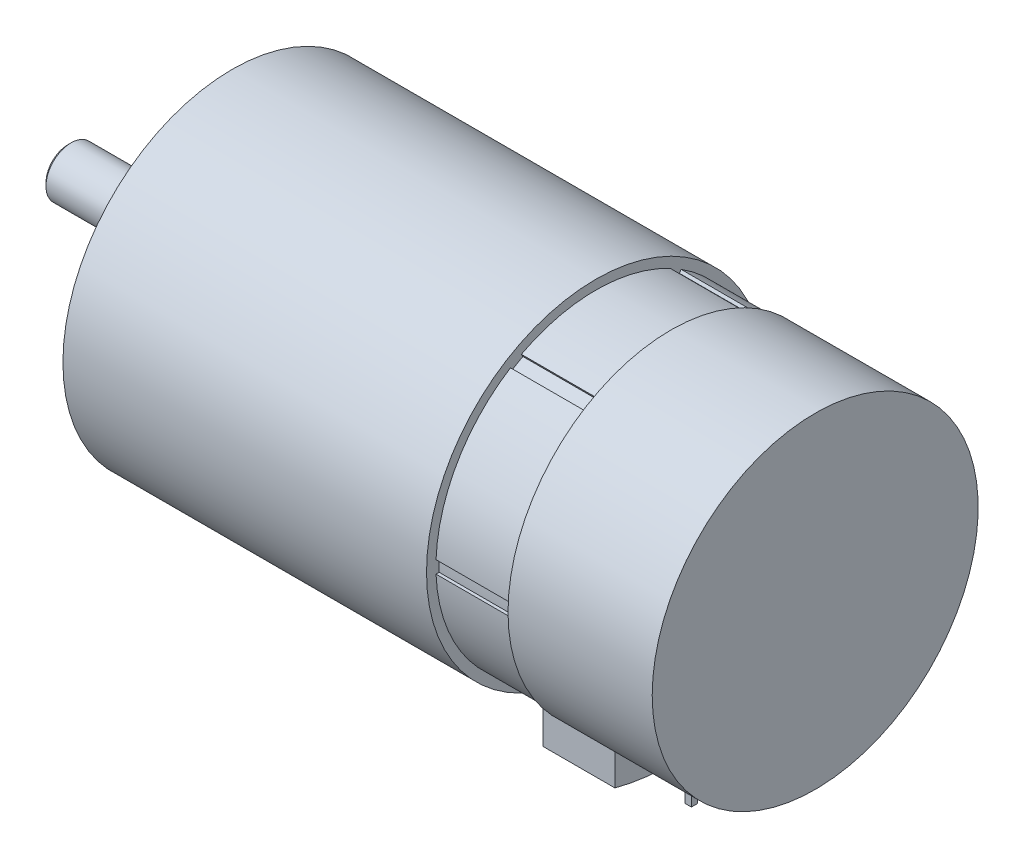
from build123d import *
from build123d.topology import SkipClean

# Parameters (mm, degrees)
SKETCH2_R                           = 2
CUT_EXTRUDE1_DEPTH                  = 6
BOSS_EXTRUDE1_START                 = 96.2
BOSS_EXTRUDE1_DEPTH                 = 11.5
CUT_EXTRUDE4_START                  = -23
CUT_EXTRUDE4_DEPTH                  = 12
BOSS_EXTRUDE2_START                 = -12.2
BOSS_EXTRUDE2_DEPTH                 = 5.8
CUT_EXTRUDE5_REACH                  = 136.563
CUT_EXTRUDE5_END_RADIUS             = 25.5
SKETCH8_W                           = 8.5
SKETCH8_H                           = 14.9
SKETCH8_W_2                         = 3.8
SKETCH8_H_2                         = 10
CUT_EXTRUDE5_DIRECTION_2_REACH      = 136.563
CUT_EXTRUDE5_DIRECTION_2_END_RADIUS = 34
CUT_EXTRUDE6_START                  = -10
CUT_EXTRUDE6_DEPTH                  = 10
CUT_EXTRUDE7_REACH                  = 136.563
CUT_EXTRUDE7_END_RADIUS             = 25.5
SKETCH10_W                          = 10.5
SKETCH10_H                          = 16.9
CUT_EXTRUDE7_DIRECTION_2_REACH      = 136.563
CUT_EXTRUDE7_DIRECTION_2_END_RADIUS = 33.5
CUT_EXTRUDE9_REACH                  = 137.063
CUT_EXTRUDE9_END_RADIUS             = 25.5
CUT_EXTRUDE9_START                  = -0.5
SKETCH12_W                          = 4.8
SKETCH12_H                          = 11
BOSS_EXTRUDE3_REACH                 = 136.563
BOSS_EXTRUDE3_END_RADIUS            = 25.5
SKETCH13_W                          = 2
SKETCH13_H                          = 2
SKETCH13_W_2                        = 1
SKETCH13_H_2                        = 1
BOSS_EXTRUDE3_DIRECTION_2_DEPTH     = 6
SKETCH14_OUTSIDE_W                  = 151.196
SKETCH14_OUTSIDE_H                  = 85.996
SKETCH14_OUTSIDE_W_2                = 1
SKETCH14_OUTSIDE_H_2                = 1
CUT_EXTRUDE11_DEPTH                 = 1.25
CUT_EXTRUDE11_TAPER                 = 22


with BuildPart() as part:
    # Sketch1 → Revolve1 (revolve)
    with BuildSketch(Plane(origin=(0, 0, 0), x_dir=(1, 0, 0), z_dir=(0, 1, 0)), mode=Mode.PRIVATE) as revolve1_sk:
        Polygon((0, 0), (0, 3.5), (0.5, 4), (22.2, 4), (22.2, 10), (23.2, 11), (26.2, 11), (26.2, 27), (84.2, 27), (84.2, 25.5), (96.2, 25.5), (96.2, 26), (119.2, 26), (119.2, 0), align=None)
    revolve(revolve1_sk.sketch.rotate(Axis((0, 0, 0), (1, 0, 0)), 180), axis=Axis((0, 0, 0), (1, 0, 0)))

    # Sketch2 → Cut-Extrude1 (cut)
    with BuildSketch(Plane.ZY.offset(-26.2)):
        with Locations((14.849242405, 14.849242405)):
            Circle(SKETCH2_R)
        with Locations((14.849242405, -14.849242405)):
            Circle(SKETCH2_R)
        with Locations((-14.849242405, -14.849242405)):
            Circle(SKETCH2_R)
        with Locations((-14.849242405, 14.849242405)):
            Circle(SKETCH2_R)
    extrude(amount=-CUT_EXTRUDE1_DEPTH, mode=Mode.SUBTRACT)

    # Sketch3 → Boss-Extrude1 (add)
    with BuildSketch(Plane(origin=(0, 0, 0), x_dir=(0, 0, -1), z_dir=(1, 0, 0)).offset(BOSS_EXTRUDE1_START)):
        with BuildLine():
            Line((-8.95, -32.800876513), (-8.95, -23.87776162))
            ThreePointArc((-8.95, -23.87776162), (0, -25.5), (8.95, -23.87776162))
            Line((8.95, -23.87776162), (8.95, -32.800876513))
            ThreePointArc((8.95, -32.800876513), (0, -34), (-8.95, -32.800876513))
        make_face()
    extrude(amount=-BOSS_EXTRUDE1_DEPTH)

    # Sketch5 → Cut-Extrude4 (cut)
    with BuildSketch(Plane(origin=(119.2, 0, 0), x_dir=(0, 0, -1), z_dir=(1, 0, 0)).offset(CUT_EXTRUDE4_START)):
        with BuildLine():
            Line((24.979991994, 1), (25.480384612, 1))
            ThreePointArc((25.480384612, 1), (25.5, 0), (25.480384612, -1))
            Line((25.480384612, -1), (24.979991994, -1))
            ThreePointArc((24.979991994, -1), (25, 0), (24.979991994, 1))
        make_face()
        with BuildLine():
            Line((13.356021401, -21.133307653), (13.60621771, -21.566660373))
            ThreePointArc((13.60621771, -21.566660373), (12.75, -22.083647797), (11.874166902, -22.566660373))
            Line((11.874166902, -22.566660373), (11.623970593, -22.133307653))
            ThreePointArc((11.623970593, -22.133307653), (12.5, -21.650635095), (13.356021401, -21.133307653))
        make_face()
        with BuildLine():
            Line((-11.623970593, -22.133307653), (-11.874166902, -22.566660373))
            ThreePointArc((-11.874166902, -22.566660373), (-12.75, -22.083647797), (-13.60621771, -21.566660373))
            Line((-13.60621771, -21.566660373), (-13.356021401, -21.133307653))
            ThreePointArc((-13.356021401, -21.133307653), (-12.5, -21.650635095), (-11.623970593, -22.133307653))
        make_face()
        with BuildLine():
            Line((-24.979991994, -1), (-25.480384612, -1))
            ThreePointArc((-25.480384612, -1), (-25.5, 0), (-25.480384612, 1))
            Line((-25.480384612, 1), (-24.979991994, 1))
            ThreePointArc((-24.979991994, 1), (-25, 0), (-24.979991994, -1))
        make_face()
        with BuildLine():
            Line((-13.356021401, 21.133307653), (-13.60621771, 21.566660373))
            ThreePointArc((-13.60621771, 21.566660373), (-12.75, 22.083647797), (-11.874166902, 22.566660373))
            Line((-11.874166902, 22.566660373), (-11.623970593, 22.133307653))
            ThreePointArc((-11.623970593, 22.133307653), (-12.5, 21.650635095), (-13.356021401, 21.133307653))
        make_face()
        with BuildLine():
            Line((11.623970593, 22.133307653), (11.874166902, 22.566660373))
            ThreePointArc((11.874166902, 22.566660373), (12.75, 22.083647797), (13.60621771, 21.566660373))
            Line((13.60621771, 21.566660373), (13.356021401, 21.133307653))
            ThreePointArc((13.356021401, 21.133307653), (12.5, 21.650635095), (11.623970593, 22.133307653))
        make_face()
    extrude(amount=-CUT_EXTRUDE4_DEPTH, mode=Mode.SUBTRACT)

    # Sketch6 → Boss-Extrude2 (add)
    with BuildSketch(Plane(origin=(119.2, 0, 0), x_dir=(0, 0, -1), z_dir=(1, 0, 0)).offset(BOSS_EXTRUDE2_START)):
        with BuildLine():
            Line((-6, -25.298221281), (-6, -29.298221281))
            Line((-6, -29.298221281), (6, -29.298221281))
            Line((6, -29.298221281), (6, -25.298221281))
            ThreePointArc((6, -25.298221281), (0, -26), (-6, -25.298221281))
        make_face()
    extrude(amount=-BOSS_EXTRUDE2_DEPTH)

    # Cut-Extrude5: up to this cylinder (the profile starts outside it)
    cut_extrude5_end = Plane(origin=(97.275, 0, 0), z_dir=(-1, 0, 0)) * Cylinder(CUT_EXTRUDE5_END_RADIUS, 338.776, mode=Mode.PRIVATE)
    # Sketch8 → Cut-Extrude5 (cut, up to the surface)
    with BuildSketch(Plane.XZ.offset(29.298221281), mode=Mode.PRIVATE) as cut_extrude5_sk1:
        with Locations((90.45, 0)):
            Rectangle(SKETCH8_W, SKETCH8_H)
    cut_extrude5_tool1 = extrude(cut_extrude5_sk1.sketch, amount=-CUT_EXTRUDE5_REACH, mode=Mode.PRIVATE) - cut_extrude5_end
    add(cut_extrude5_tool1.solids().sort_by_distance((90.45, -29.298221, 0))[0], mode=Mode.SUBTRACT)
    # Sketch8 → Cut-Extrude5 (cut, up to the surface)
    with BuildSketch(Plane.XZ.offset(29.298221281), mode=Mode.PRIVATE) as cut_extrude5_sk2:
        with Locations((104.1, 0)):
            Rectangle(SKETCH8_W_2, SKETCH8_H_2)
    cut_extrude5_tool2 = extrude(cut_extrude5_sk2.sketch, amount=-CUT_EXTRUDE5_REACH, mode=Mode.PRIVATE) - cut_extrude5_end
    add(cut_extrude5_tool2.solids().sort_by_distance((104.1, -29.298221, 0))[0], mode=Mode.SUBTRACT)

    # Cut-Extrude5 direction 2: up to this cylinder (the profile starts inside it)
    cut_extrude5_direction_2_end = Plane(origin=(97.275, 0, 0), z_dir=(-1, 0, 0)) * Cylinder(CUT_EXTRUDE5_DIRECTION_2_END_RADIUS, 355.776, mode=Mode.PRIVATE)
    # Sketch8 → Cut-Extrude5 direction 2 (cut, up to the surface)
    with BuildSketch(Plane.XZ.offset(29.298221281), mode=Mode.PRIVATE) as cut_extrude5_direction_2_sk1:
        with Locations((90.45, 0)):
            Rectangle(SKETCH8_W, SKETCH8_H)
    cut_extrude5_direction_2_tool1 = extrude(cut_extrude5_direction_2_sk1.sketch, amount=CUT_EXTRUDE5_DIRECTION_2_REACH, mode=Mode.PRIVATE) & cut_extrude5_direction_2_end
    add(cut_extrude5_direction_2_tool1.solids().sort_by_distance((90.45, -29.298221, 0))[0], mode=Mode.SUBTRACT)
    # Sketch8 → Cut-Extrude5 direction 2 (cut, up to the surface)
    with BuildSketch(Plane.XZ.offset(29.298221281), mode=Mode.PRIVATE) as cut_extrude5_direction_2_sk2:
        with Locations((104.1, 0)):
            Rectangle(SKETCH8_W_2, SKETCH8_H_2)
    cut_extrude5_direction_2_tool2 = extrude(cut_extrude5_direction_2_sk2.sketch, amount=CUT_EXTRUDE5_DIRECTION_2_REACH, mode=Mode.PRIVATE) & cut_extrude5_direction_2_end
    add(cut_extrude5_direction_2_tool2.solids().sort_by_distance((104.1, -29.298221, 0))[0], mode=Mode.SUBTRACT)

    # Sketch9 → Cut-Extrude6 (cut)
    with BuildSketch(Plane.ZY.offset(-84.7).offset(CUT_EXTRUDE6_START)):
        with BuildLine():
            Line((-7.45, -24.387445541), (-7.45, -33.17374715))
            ThreePointArc((-7.45, -33.17374715), (-6.701696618, -33.332975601), (-5.95, -33.475326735))
            Line((-5.95, -33.475326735), (-5.95, -24.796118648))
            ThreePointArc((-5.95, -24.796118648), (-6.703115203, -24.603216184), (-7.45, -24.387445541))
        make_face()
        with BuildLine():
            Line((7.45, -24.387445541), (7.45, -33.17374715))
            ThreePointArc((7.45, -33.17374715), (6.701696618, -33.332975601), (5.95, -33.475326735))
            Line((5.95, -33.475326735), (5.95, -24.796118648))
            ThreePointArc((5.95, -24.796118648), (6.703115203, -24.603216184), (7.45, -24.387445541))
        make_face()
    extrude(amount=CUT_EXTRUDE6_DEPTH, mode=Mode.SUBTRACT)

    # Cut-Extrude7: up to this cylinder (the profile starts outside it)
    with SkipClean():  # the faces are left unmerged after this step: merging them gives an invalid solid
        cut_extrude7_end = Plane(origin=(90.45, 0, 0), z_dir=(-1, 0, 0)) * Cylinder(CUT_EXTRUDE7_END_RADIUS, 325.126, mode=Mode.PRIVATE)
        # Sketch10 → Cut-Extrude7 (cut, up to the surface)
        with BuildSketch(Plane.XZ.offset(29.298221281), mode=Mode.PRIVATE) as cut_extrude7_sk1:
            with Locations((90.45, 0)):
                Rectangle(SKETCH10_W, SKETCH10_H)
        cut_extrude7_tool1 = extrude(cut_extrude7_sk1.sketch, amount=-CUT_EXTRUDE7_REACH, mode=Mode.PRIVATE) - cut_extrude7_end
        add(cut_extrude7_tool1.solids().sort_by_distance((90.45, -29.298221, 0))[0], mode=Mode.SUBTRACT)

    # Cut-Extrude7 direction 2: up to this cylinder (the profile starts inside it)
    with SkipClean():  # the faces are left unmerged after this step: merging them gives an invalid solid
        cut_extrude7_direction_2_end = Plane(origin=(90.45, 0, 0), z_dir=(-1, 0, 0)) * Cylinder(CUT_EXTRUDE7_DIRECTION_2_END_RADIUS, 341.126, mode=Mode.PRIVATE)
        # Sketch10 → Cut-Extrude7 direction 2 (cut, up to the surface)
        with BuildSketch(Plane.XZ.offset(29.298221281), mode=Mode.PRIVATE) as cut_extrude7_direction_2_sk1:
            with Locations((90.45, 0)):
                Rectangle(SKETCH10_W, SKETCH10_H)
        cut_extrude7_direction_2_tool1 = extrude(cut_extrude7_direction_2_sk1.sketch, amount=CUT_EXTRUDE7_DIRECTION_2_REACH, mode=Mode.PRIVATE) & cut_extrude7_direction_2_end
        add(cut_extrude7_direction_2_tool1.solids().sort_by_distance((90.45, -29.298221, 0))[0], mode=Mode.SUBTRACT)

    # Cut-Extrude9: up to this cylinder (the profile starts outside it)
    with SkipClean():  # the faces are left unmerged after this step: merging them gives an invalid solid
        cut_extrude9_end = Plane(origin=(104.1, 0, 0), z_dir=(-1, 0, 0)) * Cylinder(CUT_EXTRUDE9_END_RADIUS, 326.126, mode=Mode.PRIVATE)
        # Sketch12 → Cut-Extrude9 (cut, up to the surface)
        with BuildSketch(Plane.XZ.offset(29.298221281).offset(CUT_EXTRUDE9_START), mode=Mode.PRIVATE) as cut_extrude9_sk1:
            with Locations((104.1, 0)):
                Rectangle(SKETCH12_W, SKETCH12_H)
        cut_extrude9_tool1 = extrude(cut_extrude9_sk1.sketch, amount=-CUT_EXTRUDE9_REACH, mode=Mode.PRIVATE) - cut_extrude9_end
        add(cut_extrude9_tool1.solids().sort_by_distance((104.1, -28.798221, 0))[0], mode=Mode.SUBTRACT)

    # Boss-Extrude3: up to this cylinder (the profile starts outside it)
    with SkipClean():  # the faces are left unmerged after this step: merging them gives an invalid solid
        boss_extrude3_end = Plane(origin=(95.7517315, 0, 0), z_dir=(-1, 0, 0)) * Cylinder(BOSS_EXTRUDE3_END_RADIUS, 340.022537, mode=Mode.PRIVATE)
        # Sketch13 → Boss-Extrude3 (add, up to the surface)
        with BuildSketch(Plane.XZ.offset(29.298221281), mode=Mode.PRIVATE) as boss_extrude3_sk1:
            with Locations((88.303463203, 0)):
                Rectangle(SKETCH13_W, SKETCH13_H)
        boss_extrude3_tool1 = extrude(boss_extrude3_sk1.sketch, amount=-BOSS_EXTRUDE3_REACH, mode=Mode.PRIVATE) - boss_extrude3_end
        add(boss_extrude3_tool1.solids().sort_by_distance((88.303463, -29.298221, 0))[0])
        # Sketch13 → Boss-Extrude3 (add, up to the surface)
        with BuildSketch(Plane.XZ.offset(29.298221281), mode=Mode.PRIVATE) as boss_extrude3_sk2:
            with Locations((88.303463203, -4.5)):
                Rectangle(SKETCH13_W, SKETCH13_H)
        boss_extrude3_tool2 = extrude(boss_extrude3_sk2.sketch, amount=-BOSS_EXTRUDE3_REACH, mode=Mode.PRIVATE) - boss_extrude3_end
        add(boss_extrude3_tool2.solids().sort_by_distance((88.303463, -29.298221, -4.5))[0])
        # Sketch13 → Boss-Extrude3 (add, up to the surface)
        with BuildSketch(Plane.XZ.offset(29.298221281), mode=Mode.PRIVATE) as boss_extrude3_sk3:
            with Locations((88.303463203, 4.5)):
                Rectangle(SKETCH13_W, SKETCH13_H)
        boss_extrude3_tool3 = extrude(boss_extrude3_sk3.sketch, amount=-BOSS_EXTRUDE3_REACH, mode=Mode.PRIVATE) - boss_extrude3_end
        add(boss_extrude3_tool3.solids().sort_by_distance((88.303463, -29.298221, 4.5))[0])
        # Sketch13 → Boss-Extrude3 (add, up to the surface)
        with BuildSketch(Plane.XZ.offset(29.298221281), mode=Mode.PRIVATE) as boss_extrude3_sk4:
            with Locations((103.2, -1.25)):
                Rectangle(SKETCH13_W_2, SKETCH13_H_2)
        boss_extrude3_tool4 = extrude(boss_extrude3_sk4.sketch, amount=-BOSS_EXTRUDE3_REACH, mode=Mode.PRIVATE) - boss_extrude3_end
        add(boss_extrude3_tool4.solids().sort_by_distance((103.2, -29.298221, -1.25))[0])
        # Sketch13 → Boss-Extrude3 (add, up to the surface)
        with BuildSketch(Plane.XZ.offset(29.298221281), mode=Mode.PRIVATE) as boss_extrude3_sk5:
            with Locations((103.2, 1.25)):
                Rectangle(SKETCH13_W_2, SKETCH13_H_2)
        boss_extrude3_tool5 = extrude(boss_extrude3_sk5.sketch, amount=-BOSS_EXTRUDE3_REACH, mode=Mode.PRIVATE) - boss_extrude3_end
        add(boss_extrude3_tool5.solids().sort_by_distance((103.2, -29.298221, 1.25))[0])
        # Sketch13 → Boss-Extrude3 (add, up to the surface)
        with BuildSketch(Plane.XZ.offset(29.298221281), mode=Mode.PRIVATE) as boss_extrude3_sk6:
            with Locations((103.2, 3.75)):
                Rectangle(SKETCH13_W_2, SKETCH13_H_2)
        boss_extrude3_tool6 = extrude(boss_extrude3_sk6.sketch, amount=-BOSS_EXTRUDE3_REACH, mode=Mode.PRIVATE) - boss_extrude3_end
        add(boss_extrude3_tool6.solids().sort_by_distance((103.2, -29.298221, 3.75))[0])
        # Sketch13 → Boss-Extrude3 (add, up to the surface)
        with BuildSketch(Plane.XZ.offset(29.298221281), mode=Mode.PRIVATE) as boss_extrude3_sk7:
            with Locations((103.2, -3.75)):
                Rectangle(SKETCH13_W_2, SKETCH13_H_2)
        boss_extrude3_tool7 = extrude(boss_extrude3_sk7.sketch, amount=-BOSS_EXTRUDE3_REACH, mode=Mode.PRIVATE) - boss_extrude3_end
        add(boss_extrude3_tool7.solids().sort_by_distance((103.2, -29.298221, -3.75))[0])

    # Sketch13 → Boss-Extrude3 direction 2 (add)
    with SkipClean():  # the faces are left unmerged after this step: merging them gives an invalid solid
        with BuildSketch(Plane.XZ.offset(29.298221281)):
            with Locations((88.303463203, 0)):
                Rectangle(SKETCH13_W, SKETCH13_H)
            with Locations((88.303463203, -4.5)):
                Rectangle(SKETCH13_W, SKETCH13_H)
            with Locations((88.303463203, 4.5)):
                Rectangle(SKETCH13_W, SKETCH13_H)
            with Locations((103.2, -1.25)):
                Rectangle(SKETCH13_W_2, SKETCH13_H_2)
            with Locations((103.2, 1.25)):
                Rectangle(SKETCH13_W_2, SKETCH13_H_2)
            with Locations((103.2, 3.75)):
                Rectangle(SKETCH13_W_2, SKETCH13_H_2)
            with Locations((103.2, -3.75)):
                Rectangle(SKETCH13_W_2, SKETCH13_H_2)
        extrude(amount=BOSS_EXTRUDE3_DIRECTION_2_DEPTH)

    # Sketch14 outside → Cut-Extrude11 (cut)
    with SkipClean():  # the faces are left unmerged after this step: merging them gives an invalid solid
        with BuildSketch(Plane.XZ.offset(35.298221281)):
            with Locations((59.6, 0)):
                Rectangle(SKETCH14_OUTSIDE_W, SKETCH14_OUTSIDE_H)
            with Locations((88.303463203, 4.5)):
                Rectangle(SKETCH14_OUTSIDE_W_2, SKETCH14_OUTSIDE_H_2, mode=Mode.SUBTRACT)
            with Locations((88.303463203, -4.5)):
                Rectangle(SKETCH14_OUTSIDE_W_2, SKETCH14_OUTSIDE_H_2, mode=Mode.SUBTRACT)
            with Locations((88.303463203, 0)):
                Rectangle(SKETCH14_OUTSIDE_W_2, SKETCH14_OUTSIDE_H_2, mode=Mode.SUBTRACT)
        extrude(amount=-CUT_EXTRUDE11_DEPTH, taper=CUT_EXTRUDE11_TAPER, mode=Mode.SUBTRACT)


solid = part.part
